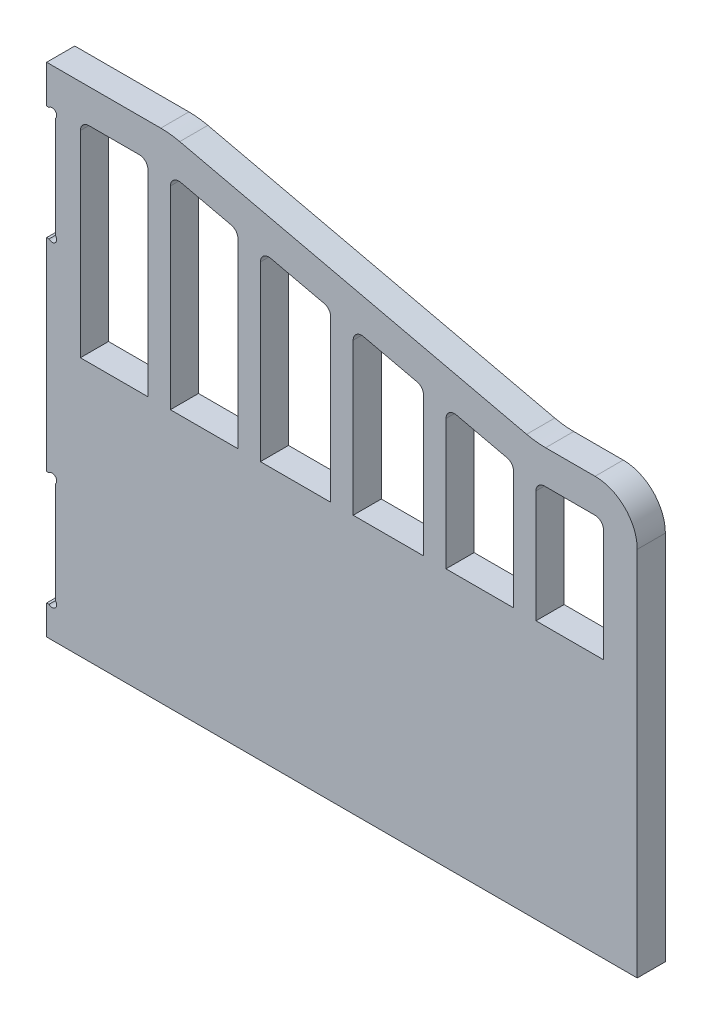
from build123d import *

# Parameters (mm, degrees)
BOSS_EXTRU_1_DEPTH      = 10
ENL_V_MAT_EXTRU_1_DEPTH = 5


with BuildPart() as part:
    # Esquisse1 → Boss.-Extru.1 (new body)
    with BuildSketch(Plane.XY):
        with BuildLine():
            Line((3.1, 164.2372583), (3.1, 128.2627417))
            ThreePointArc((3.1, 128.2627417), (3.1, 126), (0.8372583, 126))
            Line((0.8372583, 126), (0, 126))
            Line((0, 126), (0, 54))
            Line((0, 54), (0.8372583, 54))
            ThreePointArc((0.8372583, 54), (3.1, 54), (3.1, 51.7372583))
            Line((3.1, 51.7372583), (3.1, 15.7627417))
            ThreePointArc((3.1, 15.7627417), (3.1, 13.5), (0.8372583, 13.5))
            Line((0.8372583, 13.5), (0, 13.5))
            Line((0, 13.5), (0, 3))
            Line((0, 3), (210, 3))
            Line((210, 3), (210, 135))
            ThreePointArc((210, 135), (205.606601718, 145.606601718), (195, 150))
            Line((195, 150), (177.416640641, 150))
            ThreePointArc((177.416640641, 150), (174.021944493, 150.192684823), (170.67085544, 150.768264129))
            Line((170.67085544, 150.768264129), (47.32914456, 179.231735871))
            ThreePointArc((47.32914456, 179.231735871), (43.978055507, 179.807315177), (40.583359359, 180))
            Line((40.583359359, 180), (0, 180))
            Line((0, 180), (0, 166.5))
            Line((0, 166.5), (0.8372583, 166.5))
            ThreePointArc((0.8372583, 166.5), (3.1, 166.5), (3.1, 164.2372583))
        make_face()
        with BuildLine():
            Line((12, 95), (36, 95))
            Line((36, 95), (36, 165))
            ThreePointArc((36, 165), (35.121320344, 167.121320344), (33, 168))
            Line((33, 168), (15, 168))
            ThreePointArc((15, 168), (12.878679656, 167.121320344), (12, 165))
            Line((12, 165), (12, 95))
        make_face(mode=Mode.SUBTRACT)
        with BuildLine():
            Line((44, 163.913464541), (44, 95))
            Line((44, 95), (68, 95))
            Line((68, 95), (68, 159.759618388))
            ThreePointArc((68, 159.759618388), (67.347736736, 161.62727259), (65.67457852, 162.682791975))
            Line((65.67457852, 162.682791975), (47.67457852, 166.836638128))
            ThreePointArc((47.67457852, 166.836638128), (45.132345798, 166.261201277), (44, 163.913464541))
        make_face(mode=Mode.SUBTRACT)
        with BuildLine():
            Line((174, 95), (198, 95))
            Line((198, 95), (198, 135))
            ThreePointArc((198, 135), (197.121320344, 137.121320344), (195, 138))
            Line((195, 138), (177, 138))
            ThreePointArc((177, 138), (174.878679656, 137.121320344), (174, 135))
            Line((174, 135), (174, 95))
        make_face(mode=Mode.SUBTRACT)
        with BuildLine():
            Line((76, 156.528849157), (76, 95))
            Line((76, 95), (101, 95))
            Line((101, 95), (101, 152.144233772))
            ThreePointArc((101, 152.144233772), (100.347736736, 154.011887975), (98.67457852, 155.067407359))
            Line((98.67457852, 155.067407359), (79.67457852, 159.452022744))
            ThreePointArc((79.67457852, 159.452022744), (77.132345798, 158.876585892), (76, 156.528849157))
        make_face(mode=Mode.SUBTRACT)
        with BuildLine():
            Line((112.67457852, 151.836638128), (131.67457852, 147.452022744))
            ThreePointArc((131.67457852, 147.452022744), (133.347736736, 146.396503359), (134, 144.528849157))
            Line((134, 144.528849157), (134, 95))
            Line((134, 95), (109, 95))
            Line((109, 95), (109, 148.913464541))
            ThreePointArc((109, 148.913464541), (110.132345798, 151.261201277), (112.67457852, 151.836638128))
        make_face(mode=Mode.SUBTRACT)
        with BuildLine():
            Line((142, 141.298079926), (142, 95))
            Line((142, 95), (166, 95))
            Line((166, 95), (166, 137.144233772))
            ThreePointArc((166, 137.144233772), (165.347736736, 139.011887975), (163.67457852, 140.067407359))
            Line((163.67457852, 140.067407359), (145.67457852, 144.221253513))
            ThreePointArc((145.67457852, 144.221253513), (143.132345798, 143.645816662), (142, 141.298079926))
        make_face(mode=Mode.SUBTRACT)
    extrude(amount=BOSS_EXTRU_1_DEPTH)

    # Esquisse2 → Enl_v. mat.-Extru.1 (cut)
    with BuildSketch(Plane(origin=(0, 0, 0), x_dir=(-1, 0, 0), z_dir=(0, 0, -1))):
        with BuildLine():
            Line((-95, 84.7372583), (-95, 83.2627417))
            ThreePointArc((-95, 83.2627417), (-95, 81), (-92.7372583, 81))
            Line((-92.7372583, 81), (-57.2627417, 81))
            ThreePointArc((-57.2627417, 81), (-55, 81), (-55, 83.2627417))
            Line((-55, 83.2627417), (-55, 84.7372583))
            ThreePointArc((-55, 84.7372583), (-55, 87), (-57.2627417, 87))
            Line((-57.2627417, 87), (-92.7372583, 87))
            ThreePointArc((-92.7372583, 87), (-95, 87), (-95, 84.7372583))
        make_face()
    extrude(amount=-ENL_V_MAT_EXTRU_1_DEPTH, mode=Mode.SUBTRACT)


solid = part.part
